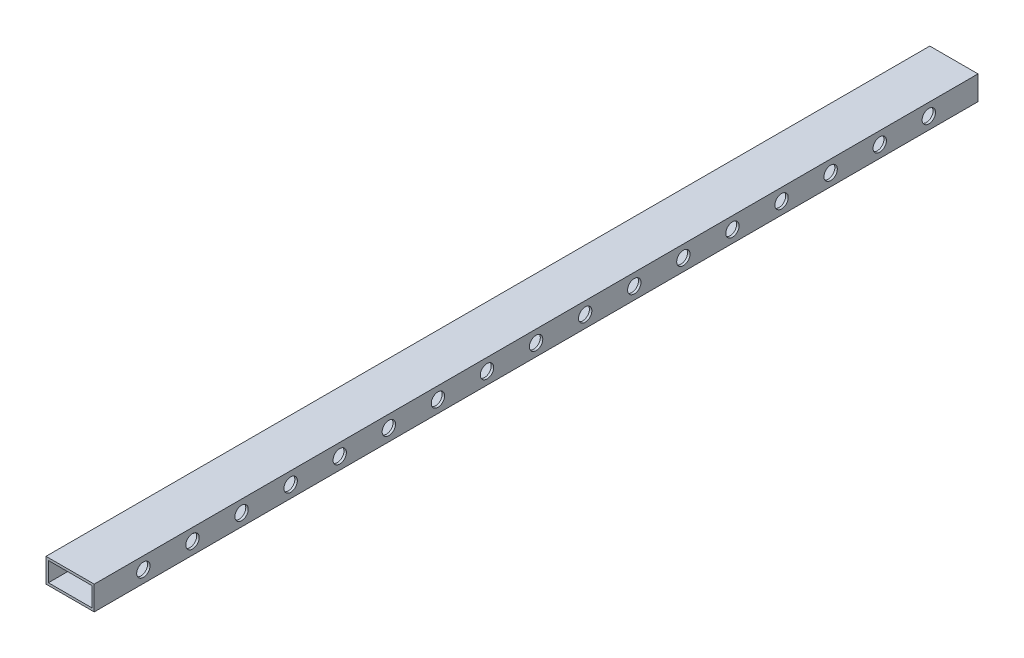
ISO-10303-21;
HEADER;
FILE_DESCRIPTION(('STEP AP214'),'2;1');
FILE_NAME('part.step','',(''),(''),'','','');
FILE_SCHEMA(('AUTOMOTIVE_DESIGN { 1 0 10303 214 1 1 1 1 }'));
ENDSEC;
DATA;
#1=APPLICATION_CONTEXT('core data for automotive mechanical design processes');
#2=APPLICATION_PROTOCOL_DEFINITION('international standard','automotive_design',2000,#1);
#3=PRODUCT_CONTEXT('',#1,'mechanical');
#4=PRODUCT('Part','Part','',(#3));
#5=PRODUCT_RELATED_PRODUCT_CATEGORY('part','',(#4));
#6=PRODUCT_DEFINITION_FORMATION('','',#4);
#7=PRODUCT_DEFINITION_CONTEXT('part definition',#1,'design');
#8=PRODUCT_DEFINITION('design','',#6,#7);
#9=PRODUCT_DEFINITION_SHAPE('','',#8);
#10=(LENGTH_UNIT() NAMED_UNIT(*) SI_UNIT(.MILLI.,.METRE.));
#11=(NAMED_UNIT(*) PLANE_ANGLE_UNIT() SI_UNIT($,.RADIAN.));
#12=(NAMED_UNIT(*) SI_UNIT($,.STERADIAN.) SOLID_ANGLE_UNIT());
#13=UNCERTAINTY_MEASURE_WITH_UNIT(LENGTH_MEASURE(1.E-05),#10,'distance_accuracy_value','');
#14=(GEOMETRIC_REPRESENTATION_CONTEXT(3) GLOBAL_UNCERTAINTY_ASSIGNED_CONTEXT((#13)) GLOBAL_UNIT_ASSIGNED_CONTEXT((#10,
#11,#12)) REPRESENTATION_CONTEXT('',''));
#15=CARTESIAN_POINT('',(0.,0.,0.));
#16=DIRECTION('',(0.,0.,1.));
#17=DIRECTION('',(1.,0.,0.));
#18=AXIS2_PLACEMENT_3D('',#15,#16,#17);
#19=CARTESIAN_POINT('',(-30.,-15.,1100.));
#20=DIRECTION('',(0.,0.,1.));
#21=DIRECTION('',(1.,0.,0.));
#22=AXIS2_PLACEMENT_3D('',#19,#20,#21);
#23=PLANE('',#22);
#24=DIRECTION('',(0.,-1.,0.));
#25=VECTOR('',#24,1.);
#26=CARTESIAN_POINT('',(-30.,15.,1100.));
#27=LINE('',#26,#25);
#28=CARTESIAN_POINT('',(-30.,15.,1100.));
#29=VERTEX_POINT('',#28);
#30=CARTESIAN_POINT('',(-30.,-15.,1100.));
#31=VERTEX_POINT('',#30);
#32=EDGE_CURVE('E159',#29,#31,#27,.T.);
#33=ORIENTED_EDGE('',*,*,#32,.T.);
#34=DIRECTION('',(1.,0.,0.));
#35=VECTOR('',#34,1.);
#36=CARTESIAN_POINT('',(-30.,-15.,1100.));
#37=LINE('',#36,#35);
#38=CARTESIAN_POINT('',(30.,-15.,1100.));
#39=VERTEX_POINT('',#38);
#40=EDGE_CURVE('E162',#31,#39,#37,.T.);
#41=ORIENTED_EDGE('',*,*,#40,.T.);
#42=DIRECTION('',(0.,1.,0.));
#43=VECTOR('',#42,1.);
#44=CARTESIAN_POINT('',(30.,15.,1100.));
#45=LINE('',#44,#43);
#46=CARTESIAN_POINT('',(30.,15.,1100.));
#47=VERTEX_POINT('',#46);
#48=EDGE_CURVE('E165',#39,#47,#45,.T.);
#49=ORIENTED_EDGE('',*,*,#48,.T.);
#50=DIRECTION('',(-1.,0.,0.));
#51=VECTOR('',#50,1.);
#52=CARTESIAN_POINT('',(-30.,15.,1100.));
#53=LINE('',#52,#51);
#54=EDGE_CURVE('E167',#47,#29,#53,.T.);
#55=ORIENTED_EDGE('',*,*,#54,.T.);
#56=EDGE_LOOP('',(#33,#41,#49,#55));
#57=FACE_BOUND('',#56,.T.);
#58=DIRECTION('',(1.,0.,0.));
#59=VECTOR('',#58,1.);
#60=CARTESIAN_POINT('',(-30.,-12.,1100.));
#61=LINE('',#60,#59);
#62=CARTESIAN_POINT('',(-27.,-12.,1100.));
#63=VERTEX_POINT('',#62);
#64=CARTESIAN_POINT('',(27.,-12.,1100.));
#65=VERTEX_POINT('',#64);
#66=EDGE_CURVE('E129',#63,#65,#61,.T.);
#67=ORIENTED_EDGE('',*,*,#66,.F.);
#68=DIRECTION('',(0.,-1.,0.));
#69=VECTOR('',#68,1.);
#70=CARTESIAN_POINT('',(-27.,15.,1100.));
#71=LINE('',#70,#69);
#72=CARTESIAN_POINT('',(-27.,12.,1100.));
#73=VERTEX_POINT('',#72);
#74=EDGE_CURVE('E121',#73,#63,#71,.T.);
#75=ORIENTED_EDGE('',*,*,#74,.F.);
#76=DIRECTION('',(-1.,0.,0.));
#77=VECTOR('',#76,1.);
#78=CARTESIAN_POINT('',(-30.,12.,1100.));
#79=LINE('',#78,#77);
#80=CARTESIAN_POINT('',(27.,12.,1100.));
#81=VERTEX_POINT('',#80);
#82=EDGE_CURVE('E143',#81,#73,#79,.T.);
#83=ORIENTED_EDGE('',*,*,#82,.F.);
#84=DIRECTION('',(0.,1.,0.));
#85=VECTOR('',#84,1.);
#86=CARTESIAN_POINT('',(27.,15.,1100.));
#87=LINE('',#86,#85);
#88=EDGE_CURVE('E141',#65,#81,#87,.T.);
#89=ORIENTED_EDGE('',*,*,#88,.F.);
#90=EDGE_LOOP('',(#67,#75,#83,#89));
#91=FACE_BOUND('',#90,.T.);
#92=ADVANCED_FACE('F54',(#57,#91),#23,.T.);
#93=CARTESIAN_POINT('',(-30.,-15.,0.));
#94=DIRECTION('',(0.,0.,1.));
#95=DIRECTION('',(1.,0.,0.));
#96=AXIS2_PLACEMENT_3D('',#93,#94,#95);
#97=PLANE('',#96);
#98=DIRECTION('',(0.,-1.,0.));
#99=VECTOR('',#98,1.);
#100=CARTESIAN_POINT('',(-30.,15.,0.));
#101=LINE('',#100,#99);
#102=CARTESIAN_POINT('',(-30.,15.,0.));
#103=VERTEX_POINT('',#102);
#104=CARTESIAN_POINT('',(-30.,-15.,0.));
#105=VERTEX_POINT('',#104);
#106=EDGE_CURVE('E137',#103,#105,#101,.T.);
#107=ORIENTED_EDGE('',*,*,#106,.F.);
#108=DIRECTION('',(-1.,0.,0.));
#109=VECTOR('',#108,1.);
#110=CARTESIAN_POINT('',(-30.,15.,0.));
#111=LINE('',#110,#109);
#112=CARTESIAN_POINT('',(30.,15.,0.));
#113=VERTEX_POINT('',#112);
#114=EDGE_CURVE('E163',#113,#103,#111,.T.);
#115=ORIENTED_EDGE('',*,*,#114,.F.);
#116=DIRECTION('',(0.,1.,0.));
#117=VECTOR('',#116,1.);
#118=CARTESIAN_POINT('',(30.,15.,0.));
#119=LINE('',#118,#117);
#120=CARTESIAN_POINT('',(30.,-15.,0.));
#121=VERTEX_POINT('',#120);
#122=EDGE_CURVE('E174',#121,#113,#119,.T.);
#123=ORIENTED_EDGE('',*,*,#122,.F.);
#124=DIRECTION('',(1.,0.,0.));
#125=VECTOR('',#124,1.);
#126=CARTESIAN_POINT('',(-30.,-15.,0.));
#127=LINE('',#126,#125);
#128=EDGE_CURVE('E172',#105,#121,#127,.T.);
#129=ORIENTED_EDGE('',*,*,#128,.F.);
#130=EDGE_LOOP('',(#107,#115,#123,#129));
#131=FACE_BOUND('',#130,.T.);
#132=DIRECTION('',(0.,-1.,0.));
#133=VECTOR('',#132,1.);
#134=CARTESIAN_POINT('',(-27.,15.,0.));
#135=LINE('',#134,#133);
#136=CARTESIAN_POINT('',(-27.,12.,0.));
#137=VERTEX_POINT('',#136);
#138=CARTESIAN_POINT('',(-27.,-12.,0.));
#139=VERTEX_POINT('',#138);
#140=EDGE_CURVE('E79',#137,#139,#135,.T.);
#141=ORIENTED_EDGE('',*,*,#140,.T.);
#142=DIRECTION('',(1.,0.,0.));
#143=VECTOR('',#142,1.);
#144=CARTESIAN_POINT('',(-30.,-12.,0.));
#145=LINE('',#144,#143);
#146=CARTESIAN_POINT('',(27.,-12.,0.));
#147=VERTEX_POINT('',#146);
#148=EDGE_CURVE('E136',#139,#147,#145,.T.);
#149=ORIENTED_EDGE('',*,*,#148,.T.);
#150=DIRECTION('',(0.,1.,0.));
#151=VECTOR('',#150,1.);
#152=CARTESIAN_POINT('',(27.,15.,0.));
#153=LINE('',#152,#151);
#154=CARTESIAN_POINT('',(27.,12.,0.));
#155=VERTEX_POINT('',#154);
#156=EDGE_CURVE('E151',#147,#155,#153,.T.);
#157=ORIENTED_EDGE('',*,*,#156,.T.);
#158=DIRECTION('',(-1.,0.,0.));
#159=VECTOR('',#158,1.);
#160=CARTESIAN_POINT('',(-30.,12.,0.));
#161=LINE('',#160,#159);
#162=EDGE_CURVE('E130',#155,#137,#161,.T.);
#163=ORIENTED_EDGE('',*,*,#162,.T.);
#164=EDGE_LOOP('',(#141,#149,#157,#163));
#165=FACE_BOUND('',#164,.T.);
#166=ADVANCED_FACE('F297',(#131,#165),#97,.F.);
#167=CARTESIAN_POINT('',(-30.,15.,1100.));
#168=DIRECTION('',(1.,0.,0.));
#169=DIRECTION('',(0.,1.,0.));
#170=AXIS2_PLACEMENT_3D('',#167,#168,#169);
#171=PLANE('',#170);
#172=ORIENTED_EDGE('',*,*,#106,.T.);
#173=DIRECTION('',(0.,0.,-1.));
#174=VECTOR('',#173,1.);
#175=CARTESIAN_POINT('',(-30.,-15.,1100.));
#176=LINE('',#175,#174);
#177=EDGE_CURVE('E12',#31,#105,#176,.T.);
#178=ORIENTED_EDGE('',*,*,#177,.F.);
#179=ORIENTED_EDGE('',*,*,#32,.F.);
#180=DIRECTION('',(0.,0.,-1.));
#181=VECTOR('',#180,1.);
#182=CARTESIAN_POINT('',(-30.,15.,1100.));
#183=LINE('',#182,#181);
#184=EDGE_CURVE('E169',#29,#103,#183,.T.);
#185=ORIENTED_EDGE('',*,*,#184,.T.);
#186=EDGE_LOOP('',(#172,#178,#179,#185));
#187=FACE_BOUND('',#186,.T.);
#188=ADVANCED_FACE('F56',(#187),#171,.F.);
#189=CARTESIAN_POINT('',(-30.,-15.,1100.));
#190=DIRECTION('',(0.,1.,0.));
#191=DIRECTION('',(-1.,0.,0.));
#192=AXIS2_PLACEMENT_3D('',#189,#190,#191);
#193=PLANE('',#192);
#194=CARTESIAN_POINT('',(0.,-15.,950.));
#195=DIRECTION('',(0.,-1.,0.));
#196=DIRECTION('',(0.,0.,-1.));
#197=AXIS2_PLACEMENT_3D('',#194,#195,#196);
#198=CIRCLE('',#197,12.0585);
#199=CARTESIAN_POINT('',(0.,-15.,937.9415));
#200=VERTEX_POINT('',#199);
#201=EDGE_CURVE('E333',#200,#200,#198,.T.);
#202=ORIENTED_EDGE('',*,*,#201,.F.);
#203=EDGE_LOOP('',(#202));
#204=FACE_BOUND('',#203,.T.);
#205=ORIENTED_EDGE('',*,*,#128,.T.);
#206=DIRECTION('',(0.,0.,-1.));
#207=VECTOR('',#206,1.);
#208=CARTESIAN_POINT('',(30.,-15.,1100.));
#209=LINE('',#208,#207);
#210=EDGE_CURVE('E63',#39,#121,#209,.T.);
#211=ORIENTED_EDGE('',*,*,#210,.F.);
#212=ORIENTED_EDGE('',*,*,#40,.F.);
#213=ORIENTED_EDGE('',*,*,#177,.T.);
#214=EDGE_LOOP('',(#205,#211,#212,#213));
#215=FACE_BOUND('',#214,.T.);
#216=ADVANCED_FACE('F322',(#204,#215),#193,.F.);
#217=CARTESIAN_POINT('',(30.,15.,1100.));
#218=DIRECTION('',(-1.,0.,0.));
#219=DIRECTION('',(0.,0.,1.));
#220=AXIS2_PLACEMENT_3D('',#217,#218,#219);
#221=PLANE('',#220);
#222=CARTESIAN_POINT('',(30.,0.,550.));
#223=DIRECTION('',(1.,0.,0.));
#224=DIRECTION('',(0.,0.,-1.));
#225=AXIS2_PLACEMENT_3D('',#222,#223,#224);
#226=CIRCLE('',#225,8.3155);
#227=CARTESIAN_POINT('',(30.,0.,541.6845));
#228=VERTEX_POINT('',#227);
#229=EDGE_CURVE('E243',#228,#228,#226,.T.);
#230=ORIENTED_EDGE('',*,*,#229,.F.);
#231=EDGE_LOOP('',(#230));
#232=FACE_BOUND('',#231,.T.);
#233=CARTESIAN_POINT('',(30.,0.,488.9));
#234=DIRECTION('',(1.,0.,0.));
#235=DIRECTION('',(0.,0.,-1.));
#236=AXIS2_PLACEMENT_3D('',#233,#234,#235);
#237=CIRCLE('',#236,8.3155);
#238=CARTESIAN_POINT('',(30.,0.,480.5845));
#239=VERTEX_POINT('',#238);
#240=EDGE_CURVE('E233',#239,#239,#237,.T.);
#241=ORIENTED_EDGE('',*,*,#240,.F.);
#242=EDGE_LOOP('',(#241));
#243=FACE_BOUND('',#242,.T.);
#244=CARTESIAN_POINT('',(30.,0.,427.8));
#245=DIRECTION('',(1.,0.,0.));
#246=DIRECTION('',(0.,0.,-1.));
#247=AXIS2_PLACEMENT_3D('',#244,#245,#246);
#248=CIRCLE('',#247,8.3155);
#249=CARTESIAN_POINT('',(30.,0.,419.4845));
#250=VERTEX_POINT('',#249);
#251=EDGE_CURVE('E230',#250,#250,#248,.T.);
#252=ORIENTED_EDGE('',*,*,#251,.F.);
#253=EDGE_LOOP('',(#252));
#254=FACE_BOUND('',#253,.T.);
#255=CARTESIAN_POINT('',(30.,0.,366.7));
#256=DIRECTION('',(1.,0.,0.));
#257=DIRECTION('',(0.,0.,-1.));
#258=AXIS2_PLACEMENT_3D('',#255,#256,#257);
#259=CIRCLE('',#258,8.3155);
#260=CARTESIAN_POINT('',(30.,0.,358.3845));
#261=VERTEX_POINT('',#260);
#262=EDGE_CURVE('E227',#261,#261,#259,.T.);
#263=ORIENTED_EDGE('',*,*,#262,.F.);
#264=EDGE_LOOP('',(#263));
#265=FACE_BOUND('',#264,.T.);
#266=CARTESIAN_POINT('',(30.,0.,305.6));
#267=DIRECTION('',(1.,0.,0.));
#268=DIRECTION('',(0.,0.,-1.));
#269=AXIS2_PLACEMENT_3D('',#266,#267,#268);
#270=CIRCLE('',#269,8.3155);
#271=CARTESIAN_POINT('',(30.,0.,297.2845));
#272=VERTEX_POINT('',#271);
#273=EDGE_CURVE('E223',#272,#272,#270,.T.);
#274=ORIENTED_EDGE('',*,*,#273,.F.);
#275=EDGE_LOOP('',(#274));
#276=FACE_BOUND('',#275,.T.);
#277=CARTESIAN_POINT('',(30.,0.,244.5));
#278=DIRECTION('',(1.,0.,0.));
#279=DIRECTION('',(0.,0.,-1.));
#280=AXIS2_PLACEMENT_3D('',#277,#278,#279);
#281=CIRCLE('',#280,8.3155);
#282=CARTESIAN_POINT('',(30.,0.,236.1845));
#283=VERTEX_POINT('',#282);
#284=EDGE_CURVE('E222',#283,#283,#281,.T.);
#285=ORIENTED_EDGE('',*,*,#284,.F.);
#286=EDGE_LOOP('',(#285));
#287=FACE_BOUND('',#286,.T.);
#288=CARTESIAN_POINT('',(30.,0.,183.4));
#289=DIRECTION('',(1.,0.,0.));
#290=DIRECTION('',(0.,0.,-1.));
#291=AXIS2_PLACEMENT_3D('',#288,#289,#290);
#292=CIRCLE('',#291,8.3155);
#293=CARTESIAN_POINT('',(30.,0.,175.0845));
#294=VERTEX_POINT('',#293);
#295=EDGE_CURVE('E218',#294,#294,#292,.T.);
#296=ORIENTED_EDGE('',*,*,#295,.F.);
#297=EDGE_LOOP('',(#296));
#298=FACE_BOUND('',#297,.T.);
#299=CARTESIAN_POINT('',(30.,0.,122.3));
#300=DIRECTION('',(1.,0.,0.));
#301=DIRECTION('',(0.,0.,-1.));
#302=AXIS2_PLACEMENT_3D('',#299,#300,#301);
#303=CIRCLE('',#302,8.3155);
#304=CARTESIAN_POINT('',(30.,0.,113.9845));
#305=VERTEX_POINT('',#304);
#306=EDGE_CURVE('E214',#305,#305,#303,.T.);
#307=ORIENTED_EDGE('',*,*,#306,.F.);
#308=EDGE_LOOP('',(#307));
#309=FACE_BOUND('',#308,.T.);
#310=CARTESIAN_POINT('',(30.,0.,61.2));
#311=DIRECTION('',(1.,0.,0.));
#312=DIRECTION('',(0.,0.,-1.));
#313=AXIS2_PLACEMENT_3D('',#310,#311,#312);
#314=CIRCLE('',#313,8.3155);
#315=CARTESIAN_POINT('',(30.,0.,52.8845));
#316=VERTEX_POINT('',#315);
#317=EDGE_CURVE('E210',#316,#316,#314,.T.);
#318=ORIENTED_EDGE('',*,*,#317,.F.);
#319=EDGE_LOOP('',(#318));
#320=FACE_BOUND('',#319,.T.);
#321=CARTESIAN_POINT('',(30.,0.,977.7));
#322=DIRECTION('',(1.,0.,0.));
#323=DIRECTION('',(0.,0.,-1.));
#324=AXIS2_PLACEMENT_3D('',#321,#322,#323);
#325=CIRCLE('',#324,8.3155);
#326=CARTESIAN_POINT('',(30.,0.,969.3845));
#327=VERTEX_POINT('',#326);
#328=EDGE_CURVE('E206',#327,#327,#325,.T.);
#329=ORIENTED_EDGE('',*,*,#328,.F.);
#330=EDGE_LOOP('',(#329));
#331=FACE_BOUND('',#330,.T.);
#332=CARTESIAN_POINT('',(30.,0.,1038.8));
#333=DIRECTION('',(1.,0.,0.));
#334=DIRECTION('',(0.,0.,-1.));
#335=AXIS2_PLACEMENT_3D('',#332,#333,#334);
#336=CIRCLE('',#335,8.3155);
#337=CARTESIAN_POINT('',(30.,0.,1030.4845));
#338=VERTEX_POINT('',#337);
#339=EDGE_CURVE('E205',#338,#338,#336,.T.);
#340=ORIENTED_EDGE('',*,*,#339,.F.);
#341=EDGE_LOOP('',(#340));
#342=FACE_BOUND('',#341,.T.);
#343=CARTESIAN_POINT('',(30.,0.,916.6));
#344=DIRECTION('',(1.,0.,0.));
#345=DIRECTION('',(0.,0.,-1.));
#346=AXIS2_PLACEMENT_3D('',#343,#344,#345);
#347=CIRCLE('',#346,8.3155);
#348=CARTESIAN_POINT('',(30.,0.,908.2845));
#349=VERTEX_POINT('',#348);
#350=EDGE_CURVE('E201',#349,#349,#347,.T.);
#351=ORIENTED_EDGE('',*,*,#350,.F.);
#352=EDGE_LOOP('',(#351));
#353=FACE_BOUND('',#352,.T.);
#354=CARTESIAN_POINT('',(30.,0.,855.5));
#355=DIRECTION('',(1.,0.,0.));
#356=DIRECTION('',(0.,0.,-1.));
#357=AXIS2_PLACEMENT_3D('',#354,#355,#356);
#358=CIRCLE('',#357,8.3155);
#359=CARTESIAN_POINT('',(30.,0.,847.1845));
#360=VERTEX_POINT('',#359);
#361=EDGE_CURVE('E197',#360,#360,#358,.T.);
#362=ORIENTED_EDGE('',*,*,#361,.F.);
#363=EDGE_LOOP('',(#362));
#364=FACE_BOUND('',#363,.T.);
#365=CARTESIAN_POINT('',(30.,0.,794.4));
#366=DIRECTION('',(1.,0.,0.));
#367=DIRECTION('',(0.,0.,-1.));
#368=AXIS2_PLACEMENT_3D('',#365,#366,#367);
#369=CIRCLE('',#368,8.3155);
#370=CARTESIAN_POINT('',(30.,0.,786.0845));
#371=VERTEX_POINT('',#370);
#372=EDGE_CURVE('E193',#371,#371,#369,.T.);
#373=ORIENTED_EDGE('',*,*,#372,.F.);
#374=EDGE_LOOP('',(#373));
#375=FACE_BOUND('',#374,.T.);
#376=CARTESIAN_POINT('',(30.,0.,733.3));
#377=DIRECTION('',(1.,0.,0.));
#378=DIRECTION('',(0.,0.,-1.));
#379=AXIS2_PLACEMENT_3D('',#376,#377,#378);
#380=CIRCLE('',#379,8.3155);
#381=CARTESIAN_POINT('',(30.,0.,724.9845));
#382=VERTEX_POINT('',#381);
#383=EDGE_CURVE('E192',#382,#382,#380,.T.);
#384=ORIENTED_EDGE('',*,*,#383,.F.);
#385=EDGE_LOOP('',(#384));
#386=FACE_BOUND('',#385,.T.);
#387=CARTESIAN_POINT('',(30.,0.,672.2));
#388=DIRECTION('',(1.,0.,0.));
#389=DIRECTION('',(0.,0.,-1.));
#390=AXIS2_PLACEMENT_3D('',#387,#388,#389);
#391=CIRCLE('',#390,8.3155);
#392=CARTESIAN_POINT('',(30.,0.,663.8845));
#393=VERTEX_POINT('',#392);
#394=EDGE_CURVE('E188',#393,#393,#391,.T.);
#395=ORIENTED_EDGE('',*,*,#394,.F.);
#396=EDGE_LOOP('',(#395));
#397=FACE_BOUND('',#396,.T.);
#398=CARTESIAN_POINT('',(30.,0.,611.1));
#399=DIRECTION('',(1.,0.,0.));
#400=DIRECTION('',(0.,0.,-1.));
#401=AXIS2_PLACEMENT_3D('',#398,#399,#400);
#402=CIRCLE('',#401,8.3155);
#403=CARTESIAN_POINT('',(30.,0.,602.7845));
#404=VERTEX_POINT('',#403);
#405=EDGE_CURVE('E187',#404,#404,#402,.T.);
#406=ORIENTED_EDGE('',*,*,#405,.F.);
#407=EDGE_LOOP('',(#406));
#408=FACE_BOUND('',#407,.T.);
#409=ORIENTED_EDGE('',*,*,#122,.T.);
#410=DIRECTION('',(0.,0.,-1.));
#411=VECTOR('',#410,1.);
#412=CARTESIAN_POINT('',(30.,15.,1100.));
#413=LINE('',#412,#411);
#414=EDGE_CURVE('E179',#47,#113,#413,.T.);
#415=ORIENTED_EDGE('',*,*,#414,.F.);
#416=ORIENTED_EDGE('',*,*,#48,.F.);
#417=ORIENTED_EDGE('',*,*,#210,.T.);
#418=EDGE_LOOP('',(#409,#415,#416,#417));
#419=FACE_BOUND('',#418,.T.);
#420=ADVANCED_FACE('F319',(#232,#243,#254,#265,#276,#287,#298,#309,#320,#331,#342,#353,#364,
#375,#386,#397,#408,#419),#221,.F.);
#421=CARTESIAN_POINT('',(-30.,15.,1100.));
#422=DIRECTION('',(0.,-1.,0.));
#423=DIRECTION('',(1.,0.,0.));
#424=AXIS2_PLACEMENT_3D('',#421,#422,#423);
#425=PLANE('',#424);
#426=ORIENTED_EDGE('',*,*,#114,.T.);
#427=ORIENTED_EDGE('',*,*,#184,.F.);
#428=ORIENTED_EDGE('',*,*,#54,.F.);
#429=ORIENTED_EDGE('',*,*,#414,.T.);
#430=EDGE_LOOP('',(#426,#427,#428,#429));
#431=FACE_BOUND('',#430,.T.);
#432=ADVANCED_FACE('F316',(#431),#425,.F.);
#433=CARTESIAN_POINT('',(-27.,15.,1100.));
#434=DIRECTION('',(1.,0.,0.));
#435=DIRECTION('',(0.,1.,0.));
#436=AXIS2_PLACEMENT_3D('',#433,#434,#435);
#437=PLANE('',#436);
#438=ORIENTED_EDGE('',*,*,#140,.F.);
#439=DIRECTION('',(0.,0.,-1.));
#440=VECTOR('',#439,1.);
#441=CARTESIAN_POINT('',(-27.,12.,1100.));
#442=LINE('',#441,#440);
#443=EDGE_CURVE('E125',#73,#137,#442,.T.);
#444=ORIENTED_EDGE('',*,*,#443,.F.);
#445=ORIENTED_EDGE('',*,*,#74,.T.);
#446=DIRECTION('',(0.,0.,-1.));
#447=VECTOR('',#446,1.);
#448=CARTESIAN_POINT('',(-27.,-12.,1100.));
#449=LINE('',#448,#447);
#450=EDGE_CURVE('E124',#63,#139,#449,.T.);
#451=ORIENTED_EDGE('',*,*,#450,.T.);
#452=EDGE_LOOP('',(#438,#444,#445,#451));
#453=FACE_BOUND('',#452,.T.);
#454=ADVANCED_FACE('F123',(#453),#437,.T.);
#455=CARTESIAN_POINT('',(-30.,-12.,1100.));
#456=DIRECTION('',(0.,1.,0.));
#457=DIRECTION('',(-1.,0.,0.));
#458=AXIS2_PLACEMENT_3D('',#455,#456,#457);
#459=PLANE('',#458);
#460=CARTESIAN_POINT('',(0.,-12.,950.));
#461=DIRECTION('',(0.,1.,0.));
#462=DIRECTION('',(-1.,0.,0.));
#463=AXIS2_PLACEMENT_3D('',#460,#461,#462);
#464=CIRCLE('',#463,11.9648501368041);
#465=CARTESIAN_POINT('',(-11.964850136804,-12.,950.));
#466=VERTEX_POINT('',#465);
#467=EDGE_CURVE('E346',#466,#466,#464,.T.);
#468=ORIENTED_EDGE('',*,*,#467,.F.);
#469=EDGE_LOOP('',(#468));
#470=FACE_BOUND('',#469,.T.);
#471=ORIENTED_EDGE('',*,*,#148,.F.);
#472=ORIENTED_EDGE('',*,*,#450,.F.);
#473=ORIENTED_EDGE('',*,*,#66,.T.);
#474=DIRECTION('',(0.,0.,-1.));
#475=VECTOR('',#474,1.);
#476=CARTESIAN_POINT('',(27.,-12.,1100.));
#477=LINE('',#476,#475);
#478=EDGE_CURVE('E138',#65,#147,#477,.T.);
#479=ORIENTED_EDGE('',*,*,#478,.T.);
#480=EDGE_LOOP('',(#471,#472,#473,#479));
#481=FACE_BOUND('',#480,.T.);
#482=ADVANCED_FACE('F133',(#470,#481),#459,.T.);
#483=CARTESIAN_POINT('',(27.,15.,1100.));
#484=DIRECTION('',(-1.,0.,0.));
#485=DIRECTION('',(0.,0.,1.));
#486=AXIS2_PLACEMENT_3D('',#483,#484,#485);
#487=PLANE('',#486);
#488=CARTESIAN_POINT('',(27.,0.,550.));
#489=DIRECTION('',(-1.,0.,0.));
#490=DIRECTION('',(0.,0.,1.));
#491=AXIS2_PLACEMENT_3D('',#488,#489,#490);
#492=CIRCLE('',#491,8.22185013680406);
#493=CARTESIAN_POINT('',(27.,0.,558.221850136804));
#494=VERTEX_POINT('',#493);
#495=EDGE_CURVE('E58',#494,#494,#492,.T.);
#496=ORIENTED_EDGE('',*,*,#495,.F.);
#497=EDGE_LOOP('',(#496));
#498=FACE_BOUND('',#497,.T.);
#499=CARTESIAN_POINT('',(27.,0.,488.9));
#500=DIRECTION('',(-1.,0.,0.));
#501=DIRECTION('',(0.,0.,1.));
#502=AXIS2_PLACEMENT_3D('',#499,#500,#501);
#503=CIRCLE('',#502,8.22185013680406);
#504=CARTESIAN_POINT('',(27.,0.,497.121850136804));
#505=VERTEX_POINT('',#504);
#506=EDGE_CURVE('E231',#505,#505,#503,.T.);
#507=ORIENTED_EDGE('',*,*,#506,.F.);
#508=EDGE_LOOP('',(#507));
#509=FACE_BOUND('',#508,.T.);
#510=CARTESIAN_POINT('',(27.,0.,427.8));
#511=DIRECTION('',(-1.,0.,0.));
#512=DIRECTION('',(0.,0.,1.));
#513=AXIS2_PLACEMENT_3D('',#510,#511,#512);
#514=CIRCLE('',#513,8.22185013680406);
#515=CARTESIAN_POINT('',(27.,0.,436.021850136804));
#516=VERTEX_POINT('',#515);
#517=EDGE_CURVE('E228',#516,#516,#514,.T.);
#518=ORIENTED_EDGE('',*,*,#517,.F.);
#519=EDGE_LOOP('',(#518));
#520=FACE_BOUND('',#519,.T.);
#521=CARTESIAN_POINT('',(27.,0.,366.7));
#522=DIRECTION('',(-1.,0.,0.));
#523=DIRECTION('',(0.,0.,1.));
#524=AXIS2_PLACEMENT_3D('',#521,#522,#523);
#525=CIRCLE('',#524,8.22185013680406);
#526=CARTESIAN_POINT('',(27.,0.,374.921850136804));
#527=VERTEX_POINT('',#526);
#528=EDGE_CURVE('E224',#527,#527,#525,.T.);
#529=ORIENTED_EDGE('',*,*,#528,.F.);
#530=EDGE_LOOP('',(#529));
#531=FACE_BOUND('',#530,.T.);
#532=CARTESIAN_POINT('',(27.,0.,305.6));
#533=DIRECTION('',(-1.,0.,0.));
#534=DIRECTION('',(0.,0.,1.));
#535=AXIS2_PLACEMENT_3D('',#532,#533,#534);
#536=CIRCLE('',#535,8.22185013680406);
#537=CARTESIAN_POINT('',(27.,0.,313.821850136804));
#538=VERTEX_POINT('',#537);
#539=EDGE_CURVE('E219',#538,#538,#536,.T.);
#540=ORIENTED_EDGE('',*,*,#539,.F.);
#541=EDGE_LOOP('',(#540));
#542=FACE_BOUND('',#541,.T.);
#543=CARTESIAN_POINT('',(27.,0.,244.5));
#544=DIRECTION('',(-1.,0.,0.));
#545=DIRECTION('',(0.,0.,1.));
#546=AXIS2_PLACEMENT_3D('',#543,#544,#545);
#547=CIRCLE('',#546,8.22185013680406);
#548=CARTESIAN_POINT('',(27.,0.,252.721850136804));
#549=VERTEX_POINT('',#548);
#550=EDGE_CURVE('E253',#549,#549,#547,.T.);
#551=ORIENTED_EDGE('',*,*,#550,.F.);
#552=EDGE_LOOP('',(#551));
#553=FACE_BOUND('',#552,.T.);
#554=CARTESIAN_POINT('',(27.,0.,183.4));
#555=DIRECTION('',(-1.,0.,0.));
#556=DIRECTION('',(0.,0.,1.));
#557=AXIS2_PLACEMENT_3D('',#554,#555,#556);
#558=CIRCLE('',#557,8.22185013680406);
#559=CARTESIAN_POINT('',(27.,0.,191.621850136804));
#560=VERTEX_POINT('',#559);
#561=EDGE_CURVE('E215',#560,#560,#558,.T.);
#562=ORIENTED_EDGE('',*,*,#561,.F.);
#563=EDGE_LOOP('',(#562));
#564=FACE_BOUND('',#563,.T.);
#565=CARTESIAN_POINT('',(27.,0.,122.3));
#566=DIRECTION('',(-1.,0.,0.));
#567=DIRECTION('',(0.,0.,1.));
#568=AXIS2_PLACEMENT_3D('',#565,#566,#567);
#569=CIRCLE('',#568,8.22185013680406);
#570=CARTESIAN_POINT('',(27.,0.,130.521850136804));
#571=VERTEX_POINT('',#570);
#572=EDGE_CURVE('E211',#571,#571,#569,.T.);
#573=ORIENTED_EDGE('',*,*,#572,.F.);
#574=EDGE_LOOP('',(#573));
#575=FACE_BOUND('',#574,.T.);
#576=CARTESIAN_POINT('',(27.,0.,61.2));
#577=DIRECTION('',(-1.,0.,0.));
#578=DIRECTION('',(0.,0.,1.));
#579=AXIS2_PLACEMENT_3D('',#576,#577,#578);
#580=CIRCLE('',#579,8.22185013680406);
#581=CARTESIAN_POINT('',(27.,0.,69.421850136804));
#582=VERTEX_POINT('',#581);
#583=EDGE_CURVE('E207',#582,#582,#580,.T.);
#584=ORIENTED_EDGE('',*,*,#583,.F.);
#585=EDGE_LOOP('',(#584));
#586=FACE_BOUND('',#585,.T.);
#587=CARTESIAN_POINT('',(27.,0.,977.7));
#588=DIRECTION('',(-1.,0.,0.));
#589=DIRECTION('',(0.,0.,1.));
#590=AXIS2_PLACEMENT_3D('',#587,#588,#589);
#591=CIRCLE('',#590,8.22185013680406);
#592=CARTESIAN_POINT('',(27.,0.,985.921850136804));
#593=VERTEX_POINT('',#592);
#594=EDGE_CURVE('E202',#593,#593,#591,.T.);
#595=ORIENTED_EDGE('',*,*,#594,.F.);
#596=EDGE_LOOP('',(#595));
#597=FACE_BOUND('',#596,.T.);
#598=CARTESIAN_POINT('',(27.,0.,1038.8));
#599=DIRECTION('',(-1.,0.,0.));
#600=DIRECTION('',(0.,0.,1.));
#601=AXIS2_PLACEMENT_3D('',#598,#599,#600);
#602=CIRCLE('',#601,8.22185013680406);
#603=CARTESIAN_POINT('',(27.,0.,1047.0218501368));
#604=VERTEX_POINT('',#603);
#605=EDGE_CURVE('E266',#604,#604,#602,.T.);
#606=ORIENTED_EDGE('',*,*,#605,.F.);
#607=EDGE_LOOP('',(#606));
#608=FACE_BOUND('',#607,.T.);
#609=CARTESIAN_POINT('',(27.,0.,916.6));
#610=DIRECTION('',(-1.,0.,0.));
#611=DIRECTION('',(0.,0.,1.));
#612=AXIS2_PLACEMENT_3D('',#609,#610,#611);
#613=CIRCLE('',#612,8.22185013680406);
#614=CARTESIAN_POINT('',(27.,0.,924.821850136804));
#615=VERTEX_POINT('',#614);
#616=EDGE_CURVE('E198',#615,#615,#613,.T.);
#617=ORIENTED_EDGE('',*,*,#616,.F.);
#618=EDGE_LOOP('',(#617));
#619=FACE_BOUND('',#618,.T.);
#620=CARTESIAN_POINT('',(27.,0.,855.5));
#621=DIRECTION('',(-1.,0.,0.));
#622=DIRECTION('',(0.,0.,1.));
#623=AXIS2_PLACEMENT_3D('',#620,#621,#622);
#624=CIRCLE('',#623,8.22185013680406);
#625=CARTESIAN_POINT('',(27.,0.,863.721850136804));
#626=VERTEX_POINT('',#625);
#627=EDGE_CURVE('E194',#626,#626,#624,.T.);
#628=ORIENTED_EDGE('',*,*,#627,.F.);
#629=EDGE_LOOP('',(#628));
#630=FACE_BOUND('',#629,.T.);
#631=CARTESIAN_POINT('',(27.,0.,794.4));
#632=DIRECTION('',(-1.,0.,0.));
#633=DIRECTION('',(0.,0.,1.));
#634=AXIS2_PLACEMENT_3D('',#631,#632,#633);
#635=CIRCLE('',#634,8.22185013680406);
#636=CARTESIAN_POINT('',(27.,0.,802.621850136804));
#637=VERTEX_POINT('',#636);
#638=EDGE_CURVE('E189',#637,#637,#635,.T.);
#639=ORIENTED_EDGE('',*,*,#638,.F.);
#640=EDGE_LOOP('',(#639));
#641=FACE_BOUND('',#640,.T.);
#642=CARTESIAN_POINT('',(27.,0.,733.3));
#643=DIRECTION('',(-1.,0.,0.));
#644=DIRECTION('',(0.,0.,1.));
#645=AXIS2_PLACEMENT_3D('',#642,#643,#644);
#646=CIRCLE('',#645,8.22185013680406);
#647=CARTESIAN_POINT('',(27.,0.,741.521850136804));
#648=VERTEX_POINT('',#647);
#649=EDGE_CURVE('E277',#648,#648,#646,.T.);
#650=ORIENTED_EDGE('',*,*,#649,.F.);
#651=EDGE_LOOP('',(#650));
#652=FACE_BOUND('',#651,.T.);
#653=CARTESIAN_POINT('',(27.,0.,672.2));
#654=DIRECTION('',(-1.,0.,0.));
#655=DIRECTION('',(0.,0.,1.));
#656=AXIS2_PLACEMENT_3D('',#653,#654,#655);
#657=CIRCLE('',#656,8.22185013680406);
#658=CARTESIAN_POINT('',(27.,0.,680.421850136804));
#659=VERTEX_POINT('',#658);
#660=EDGE_CURVE('E184',#659,#659,#657,.T.);
#661=ORIENTED_EDGE('',*,*,#660,.F.);
#662=EDGE_LOOP('',(#661));
#663=FACE_BOUND('',#662,.T.);
#664=CARTESIAN_POINT('',(27.,0.,611.1));
#665=DIRECTION('',(-1.,0.,0.));
#666=DIRECTION('',(0.,0.,1.));
#667=AXIS2_PLACEMENT_3D('',#664,#665,#666);
#668=CIRCLE('',#667,8.22185013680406);
#669=CARTESIAN_POINT('',(27.,0.,619.321850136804));
#670=VERTEX_POINT('',#669);
#671=EDGE_CURVE('E149',#670,#670,#668,.T.);
#672=ORIENTED_EDGE('',*,*,#671,.F.);
#673=EDGE_LOOP('',(#672));
#674=FACE_BOUND('',#673,.T.);
#675=ORIENTED_EDGE('',*,*,#156,.F.);
#676=ORIENTED_EDGE('',*,*,#478,.F.);
#677=ORIENTED_EDGE('',*,*,#88,.T.);
#678=DIRECTION('',(0.,0.,-1.));
#679=VECTOR('',#678,1.);
#680=CARTESIAN_POINT('',(27.,12.,1100.));
#681=LINE('',#680,#679);
#682=EDGE_CURVE('E71',#81,#155,#681,.T.);
#683=ORIENTED_EDGE('',*,*,#682,.T.);
#684=EDGE_LOOP('',(#675,#676,#677,#683));
#685=FACE_BOUND('',#684,.T.);
#686=ADVANCED_FACE('F289',(#498,#509,#520,#531,#542,#553,#564,#575,#586,#597,#608,#619,#630,
#641,#652,#663,#674,#685),#487,.T.);
#687=CARTESIAN_POINT('',(-30.,12.,1100.));
#688=DIRECTION('',(0.,-1.,0.));
#689=DIRECTION('',(1.,0.,0.));
#690=AXIS2_PLACEMENT_3D('',#687,#688,#689);
#691=PLANE('',#690);
#692=ORIENTED_EDGE('',*,*,#162,.F.);
#693=ORIENTED_EDGE('',*,*,#682,.F.);
#694=ORIENTED_EDGE('',*,*,#82,.T.);
#695=ORIENTED_EDGE('',*,*,#443,.T.);
#696=EDGE_LOOP('',(#692,#693,#694,#695));
#697=FACE_BOUND('',#696,.T.);
#698=ADVANCED_FACE('F292',(#697),#691,.T.);
#699=CARTESIAN_POINT('',(30.,0.,611.1));
#700=DIRECTION('',(1.,0.,0.));
#701=DIRECTION('',(0.,0.,-1.));
#702=AXIS2_PLACEMENT_3D('',#699,#700,#701);
#703=CONICAL_SURFACE('',#702,8.3155,0.0312064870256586);
#704=ORIENTED_EDGE('',*,*,#671,.T.);
#705=EDGE_LOOP('',(#704));
#706=FACE_BOUND('',#705,.T.);
#707=ORIENTED_EDGE('',*,*,#405,.T.);
#708=EDGE_LOOP('',(#707));
#709=FACE_BOUND('',#708,.T.);
#710=ADVANCED_FACE('F286',(#706,#709),#703,.F.);
#711=CARTESIAN_POINT('',(30.,0.,672.2));
#712=DIRECTION('',(1.,0.,0.));
#713=DIRECTION('',(0.,0.,-1.));
#714=AXIS2_PLACEMENT_3D('',#711,#712,#713);
#715=CONICAL_SURFACE('',#714,8.3155,0.0312064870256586);
#716=ORIENTED_EDGE('',*,*,#660,.T.);
#717=EDGE_LOOP('',(#716));
#718=FACE_BOUND('',#717,.T.);
#719=ORIENTED_EDGE('',*,*,#394,.T.);
#720=EDGE_LOOP('',(#719));
#721=FACE_BOUND('',#720,.T.);
#722=ADVANCED_FACE('F303',(#718,#721),#715,.F.);
#723=CARTESIAN_POINT('',(30.,0.,733.3));
#724=DIRECTION('',(1.,0.,0.));
#725=DIRECTION('',(0.,0.,-1.));
#726=AXIS2_PLACEMENT_3D('',#723,#724,#725);
#727=CONICAL_SURFACE('',#726,8.3155,0.0312064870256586);
#728=ORIENTED_EDGE('',*,*,#649,.T.);
#729=EDGE_LOOP('',(#728));
#730=FACE_BOUND('',#729,.T.);
#731=ORIENTED_EDGE('',*,*,#383,.T.);
#732=EDGE_LOOP('',(#731));
#733=FACE_BOUND('',#732,.T.);
#734=ADVANCED_FACE('F388',(#730,#733),#727,.F.);
#735=CARTESIAN_POINT('',(30.,0.,794.4));
#736=DIRECTION('',(1.,0.,0.));
#737=DIRECTION('',(0.,0.,-1.));
#738=AXIS2_PLACEMENT_3D('',#735,#736,#737);
#739=CONICAL_SURFACE('',#738,8.3155,0.0312064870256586);
#740=ORIENTED_EDGE('',*,*,#638,.T.);
#741=EDGE_LOOP('',(#740));
#742=FACE_BOUND('',#741,.T.);
#743=ORIENTED_EDGE('',*,*,#372,.T.);
#744=EDGE_LOOP('',(#743));
#745=FACE_BOUND('',#744,.T.);
#746=ADVANCED_FACE('F394',(#742,#745),#739,.F.);
#747=CARTESIAN_POINT('',(30.,0.,855.5));
#748=DIRECTION('',(1.,0.,0.));
#749=DIRECTION('',(0.,0.,-1.));
#750=AXIS2_PLACEMENT_3D('',#747,#748,#749);
#751=CONICAL_SURFACE('',#750,8.3155,0.0312064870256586);
#752=ORIENTED_EDGE('',*,*,#627,.T.);
#753=EDGE_LOOP('',(#752));
#754=FACE_BOUND('',#753,.T.);
#755=ORIENTED_EDGE('',*,*,#361,.T.);
#756=EDGE_LOOP('',(#755));
#757=FACE_BOUND('',#756,.T.);
#758=ADVANCED_FACE('F400',(#754,#757),#751,.F.);
#759=CARTESIAN_POINT('',(30.,0.,916.6));
#760=DIRECTION('',(1.,0.,0.));
#761=DIRECTION('',(0.,0.,-1.));
#762=AXIS2_PLACEMENT_3D('',#759,#760,#761);
#763=CONICAL_SURFACE('',#762,8.3155,0.0312064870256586);
#764=ORIENTED_EDGE('',*,*,#616,.T.);
#765=EDGE_LOOP('',(#764));
#766=FACE_BOUND('',#765,.T.);
#767=ORIENTED_EDGE('',*,*,#350,.T.);
#768=EDGE_LOOP('',(#767));
#769=FACE_BOUND('',#768,.T.);
#770=ADVANCED_FACE('F404',(#766,#769),#763,.F.);
#771=CARTESIAN_POINT('',(30.,0.,1038.8));
#772=DIRECTION('',(1.,0.,0.));
#773=DIRECTION('',(0.,0.,-1.));
#774=AXIS2_PLACEMENT_3D('',#771,#772,#773);
#775=CONICAL_SURFACE('',#774,8.3155,0.0312064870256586);
#776=ORIENTED_EDGE('',*,*,#605,.T.);
#777=EDGE_LOOP('',(#776));
#778=FACE_BOUND('',#777,.T.);
#779=ORIENTED_EDGE('',*,*,#339,.T.);
#780=EDGE_LOOP('',(#779));
#781=FACE_BOUND('',#780,.T.);
#782=ADVANCED_FACE('F408',(#778,#781),#775,.F.);
#783=CARTESIAN_POINT('',(30.,0.,977.7));
#784=DIRECTION('',(1.,0.,0.));
#785=DIRECTION('',(0.,0.,-1.));
#786=AXIS2_PLACEMENT_3D('',#783,#784,#785);
#787=CONICAL_SURFACE('',#786,8.3155,0.0312064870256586);
#788=ORIENTED_EDGE('',*,*,#594,.T.);
#789=EDGE_LOOP('',(#788));
#790=FACE_BOUND('',#789,.T.);
#791=ORIENTED_EDGE('',*,*,#328,.T.);
#792=EDGE_LOOP('',(#791));
#793=FACE_BOUND('',#792,.T.);
#794=ADVANCED_FACE('F412',(#790,#793),#787,.F.);
#795=CARTESIAN_POINT('',(30.,0.,61.2));
#796=DIRECTION('',(1.,0.,0.));
#797=DIRECTION('',(0.,0.,-1.));
#798=AXIS2_PLACEMENT_3D('',#795,#796,#797);
#799=CONICAL_SURFACE('',#798,8.3155,0.0312064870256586);
#800=ORIENTED_EDGE('',*,*,#583,.T.);
#801=EDGE_LOOP('',(#800));
#802=FACE_BOUND('',#801,.T.);
#803=ORIENTED_EDGE('',*,*,#317,.T.);
#804=EDGE_LOOP('',(#803));
#805=FACE_BOUND('',#804,.T.);
#806=ADVANCED_FACE('F416',(#802,#805),#799,.F.);
#807=CARTESIAN_POINT('',(30.,0.,122.3));
#808=DIRECTION('',(1.,0.,0.));
#809=DIRECTION('',(0.,0.,-1.));
#810=AXIS2_PLACEMENT_3D('',#807,#808,#809);
#811=CONICAL_SURFACE('',#810,8.3155,0.0312064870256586);
#812=ORIENTED_EDGE('',*,*,#572,.T.);
#813=EDGE_LOOP('',(#812));
#814=FACE_BOUND('',#813,.T.);
#815=ORIENTED_EDGE('',*,*,#306,.T.);
#816=EDGE_LOOP('',(#815));
#817=FACE_BOUND('',#816,.T.);
#818=ADVANCED_FACE('F420',(#814,#817),#811,.F.);
#819=CARTESIAN_POINT('',(30.,0.,183.4));
#820=DIRECTION('',(1.,0.,0.));
#821=DIRECTION('',(0.,0.,-1.));
#822=AXIS2_PLACEMENT_3D('',#819,#820,#821);
#823=CONICAL_SURFACE('',#822,8.3155,0.0312064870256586);
#824=ORIENTED_EDGE('',*,*,#561,.T.);
#825=EDGE_LOOP('',(#824));
#826=FACE_BOUND('',#825,.T.);
#827=ORIENTED_EDGE('',*,*,#295,.T.);
#828=EDGE_LOOP('',(#827));
#829=FACE_BOUND('',#828,.T.);
#830=ADVANCED_FACE('F424',(#826,#829),#823,.F.);
#831=CARTESIAN_POINT('',(30.,0.,244.5));
#832=DIRECTION('',(1.,0.,0.));
#833=DIRECTION('',(0.,0.,-1.));
#834=AXIS2_PLACEMENT_3D('',#831,#832,#833);
#835=CONICAL_SURFACE('',#834,8.3155,0.0312064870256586);
#836=ORIENTED_EDGE('',*,*,#550,.T.);
#837=EDGE_LOOP('',(#836));
#838=FACE_BOUND('',#837,.T.);
#839=ORIENTED_EDGE('',*,*,#284,.T.);
#840=EDGE_LOOP('',(#839));
#841=FACE_BOUND('',#840,.T.);
#842=ADVANCED_FACE('F428',(#838,#841),#835,.F.);
#843=CARTESIAN_POINT('',(30.,0.,305.6));
#844=DIRECTION('',(1.,0.,0.));
#845=DIRECTION('',(0.,0.,-1.));
#846=AXIS2_PLACEMENT_3D('',#843,#844,#845);
#847=CONICAL_SURFACE('',#846,8.3155,0.0312064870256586);
#848=ORIENTED_EDGE('',*,*,#539,.T.);
#849=EDGE_LOOP('',(#848));
#850=FACE_BOUND('',#849,.T.);
#851=ORIENTED_EDGE('',*,*,#273,.T.);
#852=EDGE_LOOP('',(#851));
#853=FACE_BOUND('',#852,.T.);
#854=ADVANCED_FACE('F432',(#850,#853),#847,.F.);
#855=CARTESIAN_POINT('',(30.,0.,366.7));
#856=DIRECTION('',(1.,0.,0.));
#857=DIRECTION('',(0.,0.,-1.));
#858=AXIS2_PLACEMENT_3D('',#855,#856,#857);
#859=CONICAL_SURFACE('',#858,8.3155,0.0312064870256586);
#860=ORIENTED_EDGE('',*,*,#528,.T.);
#861=EDGE_LOOP('',(#860));
#862=FACE_BOUND('',#861,.T.);
#863=ORIENTED_EDGE('',*,*,#262,.T.);
#864=EDGE_LOOP('',(#863));
#865=FACE_BOUND('',#864,.T.);
#866=ADVANCED_FACE('F436',(#862,#865),#859,.F.);
#867=CARTESIAN_POINT('',(30.,0.,427.8));
#868=DIRECTION('',(1.,0.,0.));
#869=DIRECTION('',(0.,0.,-1.));
#870=AXIS2_PLACEMENT_3D('',#867,#868,#869);
#871=CONICAL_SURFACE('',#870,8.3155,0.0312064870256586);
#872=ORIENTED_EDGE('',*,*,#517,.T.);
#873=EDGE_LOOP('',(#872));
#874=FACE_BOUND('',#873,.T.);
#875=ORIENTED_EDGE('',*,*,#251,.T.);
#876=EDGE_LOOP('',(#875));
#877=FACE_BOUND('',#876,.T.);
#878=ADVANCED_FACE('F440',(#874,#877),#871,.F.);
#879=CARTESIAN_POINT('',(30.,0.,488.9));
#880=DIRECTION('',(1.,0.,0.));
#881=DIRECTION('',(0.,0.,-1.));
#882=AXIS2_PLACEMENT_3D('',#879,#880,#881);
#883=CONICAL_SURFACE('',#882,8.3155,0.0312064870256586);
#884=ORIENTED_EDGE('',*,*,#506,.T.);
#885=EDGE_LOOP('',(#884));
#886=FACE_BOUND('',#885,.T.);
#887=ORIENTED_EDGE('',*,*,#240,.T.);
#888=EDGE_LOOP('',(#887));
#889=FACE_BOUND('',#888,.T.);
#890=ADVANCED_FACE('F444',(#886,#889),#883,.F.);
#891=CARTESIAN_POINT('',(30.,0.,550.));
#892=DIRECTION('',(1.,0.,0.));
#893=DIRECTION('',(0.,0.,-1.));
#894=AXIS2_PLACEMENT_3D('',#891,#892,#893);
#895=CONICAL_SURFACE('',#894,8.3155,0.0312064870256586);
#896=ORIENTED_EDGE('',*,*,#495,.T.);
#897=EDGE_LOOP('',(#896));
#898=FACE_BOUND('',#897,.T.);
#899=ORIENTED_EDGE('',*,*,#229,.T.);
#900=EDGE_LOOP('',(#899));
#901=FACE_BOUND('',#900,.T.);
#902=ADVANCED_FACE('F354',(#898,#901),#895,.F.);
#903=CARTESIAN_POINT('',(0.,-15.,950.));
#904=DIRECTION('',(0.,-1.,0.));
#905=DIRECTION('',(0.,0.,-1.));
#906=AXIS2_PLACEMENT_3D('',#903,#904,#905);
#907=CONICAL_SURFACE('',#906,12.0585,0.0312064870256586);
#908=ORIENTED_EDGE('',*,*,#467,.T.);
#909=EDGE_LOOP('',(#908));
#910=FACE_BOUND('',#909,.T.);
#911=ORIENTED_EDGE('',*,*,#201,.T.);
#912=EDGE_LOOP('',(#911));
#913=FACE_BOUND('',#912,.T.);
#914=ADVANCED_FACE('F450',(#910,#913),#907,.F.);
#915=CLOSED_SHELL('',(#92,#166,#188,#216,#420,#432,#454,#482,#686,#698,#710,#722,#734,#746,#758,
#770,#782,#794,#806,#818,#830,#842,#854,#866,#878,#890,#902,#914));
#916=MANIFOLD_SOLID_BREP('B2',#915);
#917=ADVANCED_BREP_SHAPE_REPRESENTATION('',(#18,#916),#14);
#918=SHAPE_DEFINITION_REPRESENTATION(#9,#917);
ENDSEC;
END-ISO-10303-21;
